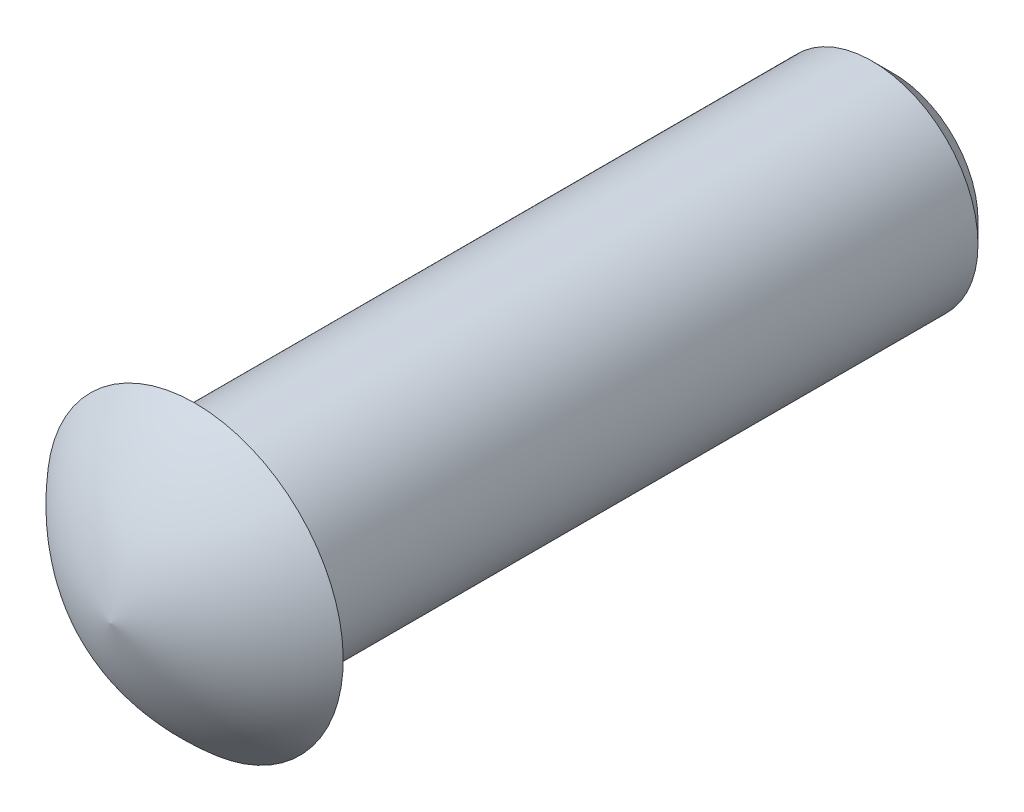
from build123d import *

# Parameters (mm, degrees)
SKETCH_1_R      = 5
EXTRUDE_1_DEPTH = 33
CHAMFER_1_SIZE  = 1


with BuildPart() as part:
    # Sketch 1 → Extrude 1 (new body)
    with BuildSketch(Plane.XY):
        Circle(SKETCH_1_R)
    extrude(amount=EXTRUDE_1_DEPTH)

    # Sketch 2 → Revolve 1 (revolve)
    with BuildSketch(Plane(origin=(0, 0, 0), x_dir=(0, 0, -1), z_dir=(1, 0, 0))):
        with BuildLine():
            Line((-33, 0), (-33, 7))
            ThreePointArc((-33, 7), (-35.6054654, 3.845980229), (-37, 0))
            Line((-37, 0), (-33, 0))
        make_face()
    revolve(axis=Axis((0, 0, 33), (0, 0, 1)))

    # Chamfer 1
    chamfer_1_edges = [part.edges().sort_by_distance(p)[0] for p in [
        (-5, 0, 0),
    ]]
    chamfer(chamfer_1_edges, length=CHAMFER_1_SIZE)


solid = part.part
